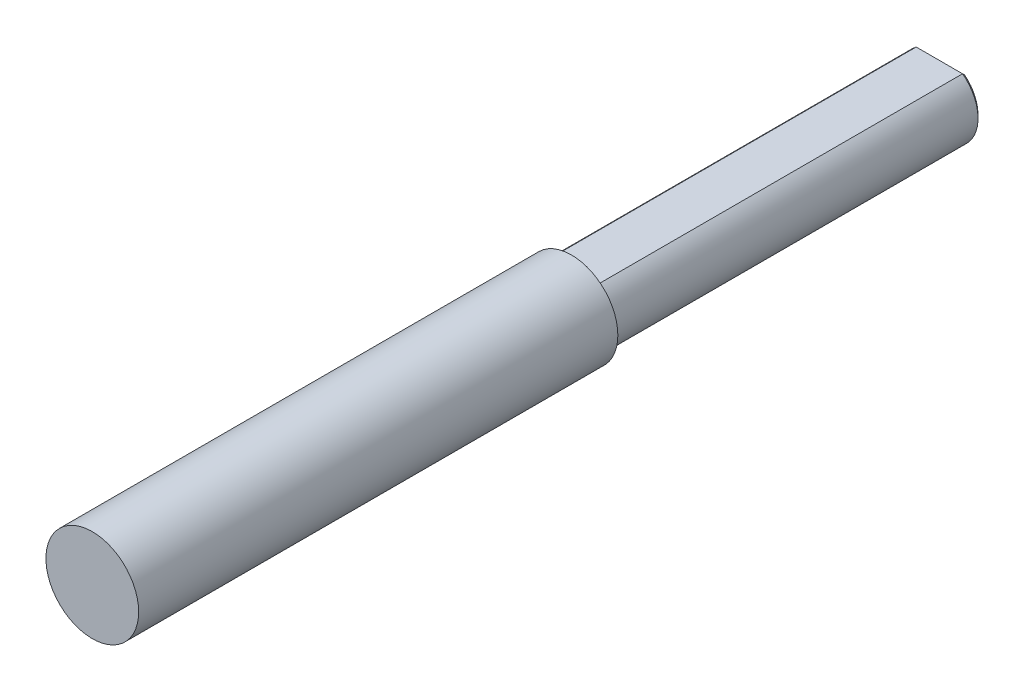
from build123d import *

# Parameters (mm, degrees)
EXTRUDE_1_DEPTH = 47
CHAMFER_1_SIZE  = 0.2
SKETCH_2_R      = 3
EXTRUDE_2_DEPTH = 23
EXTRUDE_START   = 8
SKETCH_3_R      = 3
EXTRUDE_3_DEPTH = 8


with BuildPart() as part:
    # Sketch 1 → Extrude 1 (new body)
    with BuildSketch(Plane.XY):
        with BuildLine():
            Line((-1.5, 2), (1.5, 2))
            ThreePointArc((1.5, 2), (0, -2.5), (-1.5, 2))
        make_face()
    extrude(amount=EXTRUDE_1_DEPTH)

    # Chamfer 1
    chamfer_1_edges = [part.edges().sort_by_distance(p)[0] for p in [
        (0, 2, 0),
        (0, -2.5, 0),
    ]]
    chamfer(chamfer_1_edges, length=CHAMFER_1_SIZE)

    # Sketch 2 → Extrude 2 (add)
    with BuildSketch(Plane.XY.offset(47)):
        Circle(SKETCH_2_R)
    extrude(amount=-EXTRUDE_2_DEPTH)

    # Sketch 3 → Extrude 3 (add)
    with BuildSketch(Plane.XY.offset(47).offset(EXTRUDE_START)):
        Circle(SKETCH_3_R)
    extrude(amount=-EXTRUDE_3_DEPTH)


solid = part.part
